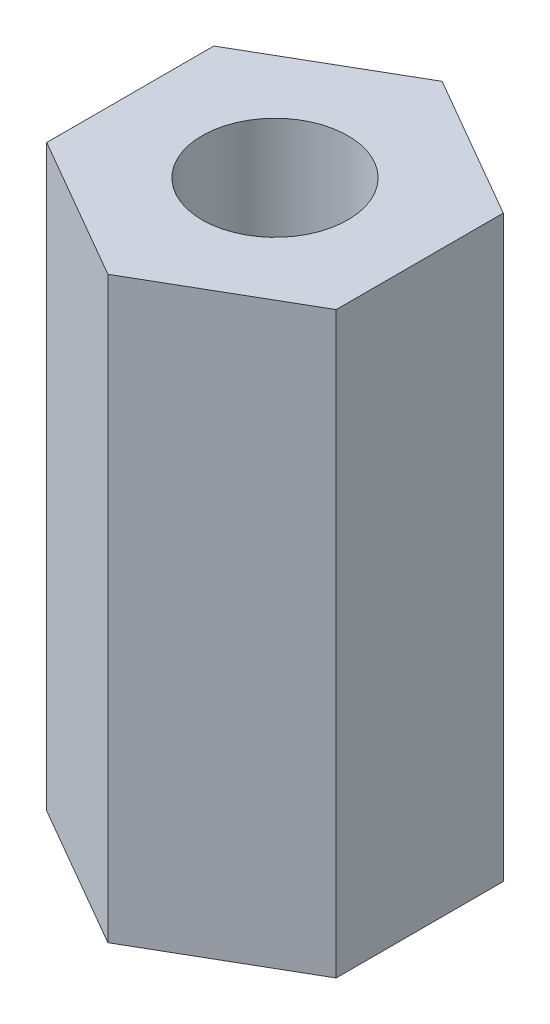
from build123d import *

# Parameters (mm, degrees)
SKETCH1_R      = 3.2004
EXTRUDE1_DEPTH = 25.4


with BuildPart() as part:
    # Sketch1 → Extrude1 (new body)
    with BuildSketch(Plane(origin=(0, 0, 0), x_dir=(1, 0, 0), z_dir=(0, 1, 0))):
        Polygon((0, 7.332348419), (-6.35, 3.666174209), (-6.35, -3.666174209), (0, -7.332348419), (6.35, -3.666174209), (6.35, 3.666174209), align=None)
        with Locations(Location((0, 0, 0), (0, 0, 270))):
            Circle(SKETCH1_R, mode=Mode.SUBTRACT)
    extrude(amount=EXTRUDE1_DEPTH)


solid = part.part
